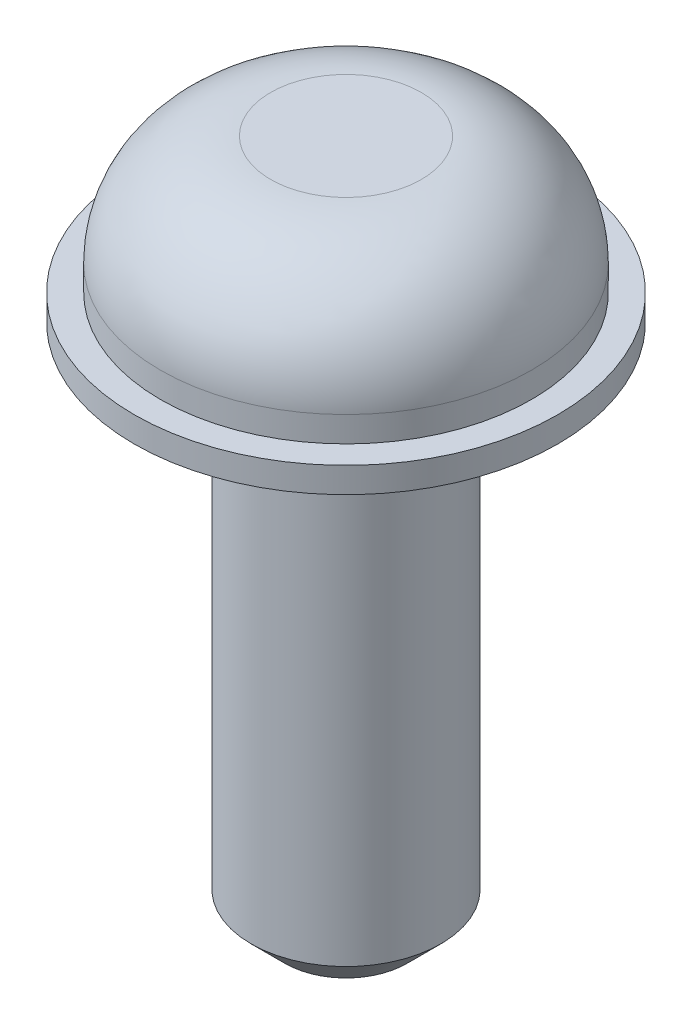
ISO-10303-21;
HEADER;
FILE_DESCRIPTION(('STEP AP214'),'2;1');
FILE_NAME('part.step','',(''),(''),'','','');
FILE_SCHEMA(('AUTOMOTIVE_DESIGN { 1 0 10303 214 1 1 1 1 }'));
ENDSEC;
DATA;
#1=APPLICATION_CONTEXT('core data for automotive mechanical design processes');
#2=APPLICATION_PROTOCOL_DEFINITION('international standard','automotive_design',2000,#1);
#3=PRODUCT_CONTEXT('',#1,'mechanical');
#4=PRODUCT('Part','Part','',(#3));
#5=PRODUCT_RELATED_PRODUCT_CATEGORY('part','',(#4));
#6=PRODUCT_DEFINITION_FORMATION('','',#4);
#7=PRODUCT_DEFINITION_CONTEXT('part definition',#1,'design');
#8=PRODUCT_DEFINITION('design','',#6,#7);
#9=PRODUCT_DEFINITION_SHAPE('','',#8);
#10=(LENGTH_UNIT() NAMED_UNIT(*) SI_UNIT(.MILLI.,.METRE.));
#11=(NAMED_UNIT(*) PLANE_ANGLE_UNIT() SI_UNIT($,.RADIAN.));
#12=(NAMED_UNIT(*) SI_UNIT($,.STERADIAN.) SOLID_ANGLE_UNIT());
#13=UNCERTAINTY_MEASURE_WITH_UNIT(LENGTH_MEASURE(1.E-05),#10,'distance_accuracy_value','');
#14=(GEOMETRIC_REPRESENTATION_CONTEXT(3) GLOBAL_UNCERTAINTY_ASSIGNED_CONTEXT((#13)) GLOBAL_UNIT_ASSIGNED_CONTEXT((#10,
#11,#12)) REPRESENTATION_CONTEXT('',''));
#15=CARTESIAN_POINT('',(0.,0.,0.));
#16=DIRECTION('',(0.,0.,1.));
#17=DIRECTION('',(1.,0.,0.));
#18=AXIS2_PLACEMENT_3D('',#15,#16,#17);
#19=CARTESIAN_POINT('',(0.,2.41300000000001,0.));
#20=DIRECTION('',(0.,-1.,0.));
#21=DIRECTION('',(0.,0.,-1.));
#22=AXIS2_PLACEMENT_3D('',#19,#20,#21);
#23=PLANE('',#22);
#24=CARTESIAN_POINT('',(0.,2.41300000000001,0.));
#25=DIRECTION('',(0.,-1.,0.));
#26=DIRECTION('',(0.,0.,-1.));
#27=AXIS2_PLACEMENT_3D('',#24,#25,#26);
#28=CIRCLE('',#27,1.1303);
#29=CARTESIAN_POINT('',(0.,2.41300000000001,-1.13030000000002));
#30=VERTEX_POINT('',#29);
#31=EDGE_CURVE('E42',#30,#30,#28,.F.);
#32=ORIENTED_EDGE('',*,*,#31,.T.);
#33=EDGE_LOOP('',(#32));
#34=FACE_BOUND('',#33,.T.);
#35=ADVANCED_FACE('F28',(#34),#23,.F.);
#36=CARTESIAN_POINT('',(0.,10.708502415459,0.));
#37=DIRECTION('',(0.,1.,0.));
#38=DIRECTION('',(0.,0.,1.));
#39=AXIS2_PLACEMENT_3D('',#36,#37,#38);
#40=CYLINDRICAL_SURFACE('',#39,2.7813);
#41=CARTESIAN_POINT('',(0.,0.762000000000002,0.));
#42=DIRECTION('',(0.,-1.,0.));
#43=DIRECTION('',(0.,0.,-1.));
#44=AXIS2_PLACEMENT_3D('',#41,#42,#43);
#45=CIRCLE('',#44,2.7813);
#46=CARTESIAN_POINT('',(0.,0.762000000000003,-2.78129999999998));
#47=VERTEX_POINT('',#46);
#48=EDGE_CURVE('E38',#47,#47,#45,.T.);
#49=ORIENTED_EDGE('',*,*,#48,.T.);
#50=EDGE_LOOP('',(#49));
#51=FACE_BOUND('',#50,.T.);
#52=CARTESIAN_POINT('',(0.,0.381000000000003,0.));
#53=DIRECTION('',(0.,1.,0.));
#54=DIRECTION('',(0.,0.,1.));
#55=AXIS2_PLACEMENT_3D('',#52,#53,#54);
#56=CIRCLE('',#55,2.7813);
#57=CARTESIAN_POINT('',(0.,0.381000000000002,2.78130000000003));
#58=VERTEX_POINT('',#57);
#59=EDGE_CURVE('E47',#58,#58,#56,.T.);
#60=ORIENTED_EDGE('',*,*,#59,.T.);
#61=EDGE_LOOP('',(#60));
#62=FACE_BOUND('',#61,.T.);
#63=ADVANCED_FACE('F76',(#51,#62),#40,.T.);
#64=CARTESIAN_POINT('',(0.,0.380999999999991,-3.17500000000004));
#65=DIRECTION('',(0.,-1.,0.));
#66=DIRECTION('',(0.,0.,-1.));
#67=AXIS2_PLACEMENT_3D('',#64,#65,#66);
#68=PLANE('',#67);
#69=ORIENTED_EDGE('',*,*,#59,.F.);
#70=EDGE_LOOP('',(#69));
#71=FACE_BOUND('',#70,.T.);
#72=CARTESIAN_POINT('',(0.,0.381000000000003,0.));
#73=DIRECTION('',(0.,1.,0.));
#74=DIRECTION('',(0.,0.,1.));
#75=AXIS2_PLACEMENT_3D('',#72,#73,#74);
#76=CIRCLE('',#75,3.175);
#77=CARTESIAN_POINT('',(0.,0.381000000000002,3.17500000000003));
#78=VERTEX_POINT('',#77);
#79=EDGE_CURVE('E50',#78,#78,#76,.T.);
#80=ORIENTED_EDGE('',*,*,#79,.T.);
#81=EDGE_LOOP('',(#80));
#82=FACE_BOUND('',#81,.T.);
#83=ADVANCED_FACE('F81',(#71,#82),#68,.F.);
#84=CARTESIAN_POINT('',(0.,10.708502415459,0.));
#85=DIRECTION('',(0.,1.,0.));
#86=DIRECTION('',(0.,0.,1.));
#87=AXIS2_PLACEMENT_3D('',#84,#85,#86);
#88=CYLINDRICAL_SURFACE('',#87,3.175);
#89=ORIENTED_EDGE('',*,*,#79,.F.);
#90=EDGE_LOOP('',(#89));
#91=FACE_BOUND('',#90,.T.);
#92=CARTESIAN_POINT('',(0.,0.,0.));
#93=DIRECTION('',(0.,1.,0.));
#94=DIRECTION('',(0.,0.,1.));
#95=AXIS2_PLACEMENT_3D('',#92,#93,#94);
#96=CIRCLE('',#95,3.175);
#97=CARTESIAN_POINT('',(0.,0.,3.175));
#98=VERTEX_POINT('',#97);
#99=EDGE_CURVE('E53',#98,#98,#96,.T.);
#100=ORIENTED_EDGE('',*,*,#99,.T.);
#101=EDGE_LOOP('',(#100));
#102=FACE_BOUND('',#101,.T.);
#103=ADVANCED_FACE('F72',(#91,#102),#88,.T.);
#104=CARTESIAN_POINT('',(0.,0.,-1.42240000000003));
#105=DIRECTION('',(0.,1.,0.));
#106=DIRECTION('',(0.,0.,1.));
#107=AXIS2_PLACEMENT_3D('',#104,#105,#106);
#108=PLANE('',#107);
#109=ORIENTED_EDGE('',*,*,#99,.F.);
#110=EDGE_LOOP('',(#109));
#111=FACE_BOUND('',#110,.T.);
#112=CARTESIAN_POINT('',(0.,0.,0.));
#113=DIRECTION('',(0.,1.,0.));
#114=DIRECTION('',(0.,0.,1.));
#115=AXIS2_PLACEMENT_3D('',#112,#113,#114);
#116=CIRCLE('',#115,1.4224);
#117=CARTESIAN_POINT('',(0.,0.,1.4224));
#118=VERTEX_POINT('',#117);
#119=EDGE_CURVE('E56',#118,#118,#116,.T.);
#120=ORIENTED_EDGE('',*,*,#119,.T.);
#121=EDGE_LOOP('',(#120));
#122=FACE_BOUND('',#121,.T.);
#123=ADVANCED_FACE('F60',(#111,#122),#108,.F.);
#124=CARTESIAN_POINT('',(0.,10.708502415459,0.));
#125=DIRECTION('',(0.,1.,0.));
#126=DIRECTION('',(0.,0.,1.));
#127=AXIS2_PLACEMENT_3D('',#124,#125,#126);
#128=CYLINDRICAL_SURFACE('',#127,1.4224);
#129=CARTESIAN_POINT('',(0.,-7.366,0.));
#130=DIRECTION('',(0.,1.,0.));
#131=DIRECTION('',(0.,0.,1.));
#132=AXIS2_PLACEMENT_3D('',#129,#130,#131);
#133=CIRCLE('',#132,1.4224);
#134=CARTESIAN_POINT('',(0.,-7.366,1.42239999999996));
#135=VERTEX_POINT('',#134);
#136=EDGE_CURVE('E34',#135,#135,#133,.T.);
#137=ORIENTED_EDGE('',*,*,#136,.T.);
#138=EDGE_LOOP('',(#137));
#139=FACE_BOUND('',#138,.T.);
#140=ORIENTED_EDGE('',*,*,#119,.F.);
#141=EDGE_LOOP('',(#140));
#142=FACE_BOUND('',#141,.T.);
#143=ADVANCED_FACE('F62',(#139,#142),#128,.T.);
#144=CARTESIAN_POINT('',(0.,-7.87400000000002,-1.42240000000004));
#145=DIRECTION('',(0.,1.,0.));
#146=DIRECTION('',(0.,0.,1.));
#147=AXIS2_PLACEMENT_3D('',#144,#145,#146);
#148=PLANE('',#147);
#149=CARTESIAN_POINT('',(0.,-7.87399999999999,0.));
#150=DIRECTION('',(0.,1.,0.));
#151=DIRECTION('',(0.,0.,1.));
#152=AXIS2_PLACEMENT_3D('',#149,#150,#151);
#153=CIRCLE('',#152,0.914400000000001);
#154=CARTESIAN_POINT('',(0.,-7.87399999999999,0.914399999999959));
#155=VERTEX_POINT('',#154);
#156=EDGE_CURVE('E10',#155,#155,#153,.F.);
#157=ORIENTED_EDGE('',*,*,#156,.T.);
#158=EDGE_LOOP('',(#157));
#159=FACE_BOUND('',#158,.T.);
#160=ADVANCED_FACE('F64',(#159),#148,.F.);
#161=CARTESIAN_POINT('',(0.,0.762000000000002,0.));
#162=DIRECTION('',(0.,-1.,0.));
#163=DIRECTION('',(0.,0.,-1.));
#164=AXIS2_PLACEMENT_3D('',#161,#162,#163);
#165=DEGENERATE_TOROIDAL_SURFACE('',#164,1.1303,1.651,.T.);
#166=ORIENTED_EDGE('',*,*,#48,.F.);
#167=EDGE_LOOP('',(#166));
#168=FACE_BOUND('',#167,.T.);
#169=ORIENTED_EDGE('',*,*,#31,.F.);
#170=EDGE_LOOP('',(#169));
#171=FACE_BOUND('',#170,.T.);
#172=ADVANCED_FACE('F70',(#168,#171),#165,.T.);
#173=CARTESIAN_POINT('',(0.,-7.366,0.));
#174=DIRECTION('',(0.,1.,0.));
#175=DIRECTION('',(0.,0.,1.));
#176=AXIS2_PLACEMENT_3D('',#173,#174,#175);
#177=CONICAL_SURFACE('',#176,1.4224,0.785398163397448);
#178=ORIENTED_EDGE('',*,*,#156,.F.);
#179=EDGE_LOOP('',(#178));
#180=FACE_BOUND('',#179,.T.);
#181=ORIENTED_EDGE('',*,*,#136,.F.);
#182=EDGE_LOOP('',(#181));
#183=FACE_BOUND('',#182,.T.);
#184=ADVANCED_FACE('F86',(#180,#183),#177,.T.);
#185=CLOSED_SHELL('',(#35,#63,#83,#103,#123,#143,#160,#172,#184));
#186=MANIFOLD_SOLID_BREP('B2',#185);
#187=ADVANCED_BREP_SHAPE_REPRESENTATION('',(#18,#186),#14);
#188=SHAPE_DEFINITION_REPRESENTATION(#9,#187);
ENDSEC;
END-ISO-10303-21;
